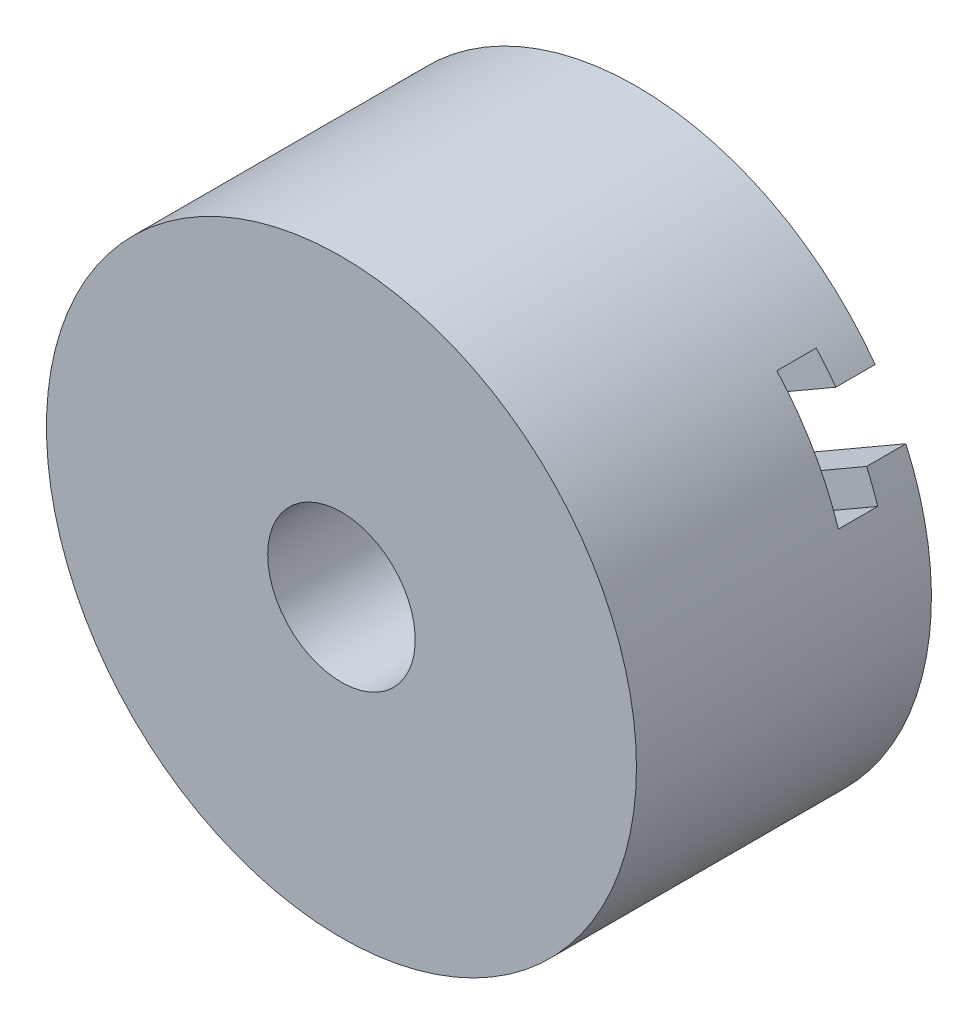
from build123d import *

# Parameters (mm, degrees)
ESQUISSE1_R                  = 120
BOSS_EXTRU_1_DEPTH           = 120
ESQUISSE4_R                  = 30
ENL_V_MAT_EXTRU_2_DEPTH      = 208.846096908
ENL_V_MAT_EXTRU_1_DEPTH      = 208.846096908
R_P_TITION_CIRCULAIRE1_COUNT = 3


with BuildPart() as part:
    # Esquisse1 → Boss.-Extru.1 (new body)
    with BuildSketch(Plane.XY):
        Circle(ESQUISSE1_R)
    extrude(amount=BOSS_EXTRU_1_DEPTH)

    # Esquisse4 → Enl_v. mat.-Extru.2 (cut, through all)
    with BuildSketch(Plane(origin=(0, 0, 0), x_dir=(-1, 0, 0), z_dir=(0, 0, -1))):
        Circle(ESQUISSE4_R)
    extrude(amount=-ENL_V_MAT_EXTRU_2_DEPTH, mode=Mode.SUBTRACT)

    # Esquisse3 → Enl_v. mat.-Extru.1 (cut, through all)
    with BuildSketch(Plane(origin=(0, 0, 0), x_dir=(1, 0, 0), z_dir=(0, 1, 0))):
        Polygon((-12.5, 0), (12.5, 0), (12.5, -16), (25, -16), (25, -32), (-25, -32), (-25, -16), (-12.5, -16), align=None)
    enl_v_mat_extru_1 = extrude(amount=-ENL_V_MAT_EXTRU_1_DEPTH, mode=Mode.SUBTRACT)

    # R_p_tition circulaire1: Enl_v. mat.-Extru.1 ×3 about axis
    r_p_tition_circulaire1_axis = Axis((0, 0, 0), (0, 0, 1))
    for i in range(1, R_P_TITION_CIRCULAIRE1_COUNT):
        add(enl_v_mat_extru_1.rotate(r_p_tition_circulaire1_axis, i * 360 / R_P_TITION_CIRCULAIRE1_COUNT), mode=Mode.SUBTRACT)


solid = part.part
